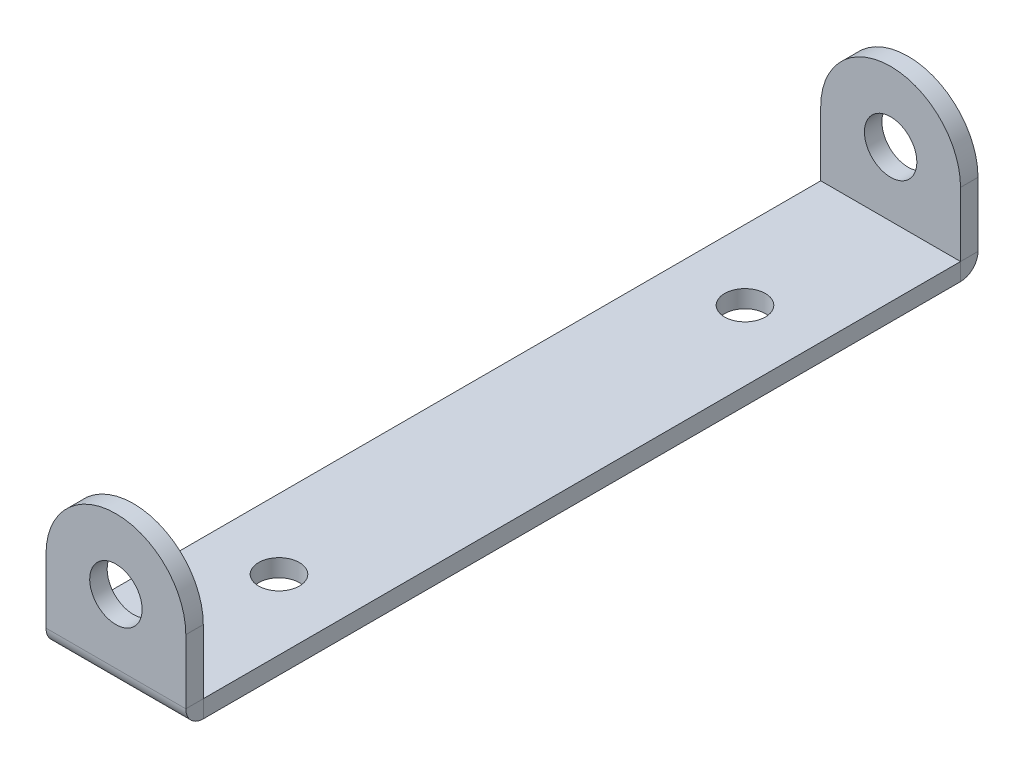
ISO-10303-21;
HEADER;
FILE_DESCRIPTION(('STEP AP214'),'2;1');
FILE_NAME('part.step','',(''),(''),'','','');
FILE_SCHEMA(('AUTOMOTIVE_DESIGN { 1 0 10303 214 1 1 1 1 }'));
ENDSEC;
DATA;
#1=APPLICATION_CONTEXT('core data for automotive mechanical design processes');
#2=APPLICATION_PROTOCOL_DEFINITION('international standard','automotive_design',2000,#1);
#3=PRODUCT_CONTEXT('',#1,'mechanical');
#4=PRODUCT('Part','Part','',(#3));
#5=PRODUCT_RELATED_PRODUCT_CATEGORY('part','',(#4));
#6=PRODUCT_DEFINITION_FORMATION('','',#4);
#7=PRODUCT_DEFINITION_CONTEXT('part definition',#1,'design');
#8=PRODUCT_DEFINITION('design','',#6,#7);
#9=PRODUCT_DEFINITION_SHAPE('','',#8);
#10=(LENGTH_UNIT() NAMED_UNIT(*) SI_UNIT(.MILLI.,.METRE.));
#11=(NAMED_UNIT(*) PLANE_ANGLE_UNIT() SI_UNIT($,.RADIAN.));
#12=(NAMED_UNIT(*) SI_UNIT($,.STERADIAN.) SOLID_ANGLE_UNIT());
#13=UNCERTAINTY_MEASURE_WITH_UNIT(LENGTH_MEASURE(1.E-05),#10,'distance_accuracy_value','');
#14=(GEOMETRIC_REPRESENTATION_CONTEXT(3) GLOBAL_UNCERTAINTY_ASSIGNED_CONTEXT((#13)) GLOBAL_UNIT_ASSIGNED_CONTEXT((#10,
#11,#12)) REPRESENTATION_CONTEXT('',''));
#15=CARTESIAN_POINT('',(0.,0.,0.));
#16=DIRECTION('',(0.,0.,1.));
#17=DIRECTION('',(1.,0.,0.));
#18=AXIS2_PLACEMENT_3D('',#15,#16,#17);
#19=CARTESIAN_POINT('',(0.,1.5,0.));
#20=DIRECTION('',(0.,1.,0.));
#21=DIRECTION('',(0.,0.,1.));
#22=AXIS2_PLACEMENT_3D('',#19,#20,#21);
#23=PLANE('',#22);
#24=CARTESIAN_POINT('',(0.,1.5,-21.));
#25=DIRECTION('',(0.,1.,0.));
#26=DIRECTION('',(0.,0.,1.));
#27=AXIS2_PLACEMENT_3D('',#24,#25,#26);
#28=CIRCLE('',#27,1.75);
#29=CARTESIAN_POINT('',(0.,1.5,-19.25));
#30=VERTEX_POINT('',#29);
#31=EDGE_CURVE('E204',#30,#30,#28,.T.);
#32=ORIENTED_EDGE('',*,*,#31,.F.);
#33=EDGE_LOOP('',(#32));
#34=FACE_BOUND('',#33,.T.);
#35=CARTESIAN_POINT('',(0.,1.5,-61.));
#36=DIRECTION('',(0.,1.,0.));
#37=DIRECTION('',(0.,0.,1.));
#38=AXIS2_PLACEMENT_3D('',#35,#36,#37);
#39=CIRCLE('',#38,1.75);
#40=CARTESIAN_POINT('',(0.,1.5,-59.25));
#41=VERTEX_POINT('',#40);
#42=EDGE_CURVE('E210',#41,#41,#39,.T.);
#43=ORIENTED_EDGE('',*,*,#42,.F.);
#44=EDGE_LOOP('',(#43));
#45=FACE_BOUND('',#44,.T.);
#46=DIRECTION('',(0.,0.,-1.));
#47=VECTOR('',#46,1.);
#48=CARTESIAN_POINT('',(6.,1.5,0.));
#49=LINE('',#48,#47);
#50=CARTESIAN_POINT('',(6.,1.5,-8.49999999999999));
#51=VERTEX_POINT('',#50);
#52=CARTESIAN_POINT('',(6.,1.5,-73.5));
#53=VERTEX_POINT('',#52);
#54=EDGE_CURVE('E44',#51,#53,#49,.T.);
#55=ORIENTED_EDGE('',*,*,#54,.T.);
#56=DIRECTION('',(-1.,0.,0.));
#57=VECTOR('',#56,1.);
#58=CARTESIAN_POINT('',(0.,1.5,-73.5));
#59=LINE('',#58,#57);
#60=CARTESIAN_POINT('',(-6.,1.5,-73.5));
#61=VERTEX_POINT('',#60);
#62=EDGE_CURVE('E224',#53,#61,#59,.T.);
#63=ORIENTED_EDGE('',*,*,#62,.T.);
#64=DIRECTION('',(0.,0.,1.));
#65=VECTOR('',#64,1.);
#66=CARTESIAN_POINT('',(-6.,1.5,0.));
#67=LINE('',#66,#65);
#68=CARTESIAN_POINT('',(-6.,1.5,-8.49999999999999));
#69=VERTEX_POINT('',#68);
#70=EDGE_CURVE('E217',#61,#69,#67,.T.);
#71=ORIENTED_EDGE('',*,*,#70,.T.);
#72=DIRECTION('',(-1.,0.,0.));
#73=VECTOR('',#72,1.);
#74=CARTESIAN_POINT('',(0.,1.5,-8.49999999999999));
#75=LINE('',#74,#73);
#76=EDGE_CURVE('E213',#51,#69,#75,.T.);
#77=ORIENTED_EDGE('',*,*,#76,.F.);
#78=EDGE_LOOP('',(#55,#63,#71,#77));
#79=FACE_BOUND('',#78,.T.);
#80=ADVANCED_FACE('F40',(#34,#45,#79),#23,.T.);
#81=CARTESIAN_POINT('',(-6.,1.5,0.));
#82=DIRECTION('',(1.,0.,0.));
#83=DIRECTION('',(0.,0.,-1.));
#84=AXIS2_PLACEMENT_3D('',#81,#82,#83);
#85=PLANE('',#84);
#86=DIRECTION('',(0.,1.,0.));
#87=VECTOR('',#86,1.);
#88=CARTESIAN_POINT('',(-6.,1.5,-73.5));
#89=LINE('',#88,#87);
#90=CARTESIAN_POINT('',(-6.,0.,-73.5));
#91=VERTEX_POINT('',#90);
#92=EDGE_CURVE('E12',#91,#61,#89,.T.);
#93=ORIENTED_EDGE('',*,*,#92,.F.);
#94=DIRECTION('',(0.,0.,1.));
#95=VECTOR('',#94,1.);
#96=CARTESIAN_POINT('',(-6.,0.,0.));
#97=LINE('',#96,#95);
#98=CARTESIAN_POINT('',(-6.,0.,-8.49999999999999));
#99=VERTEX_POINT('',#98);
#100=EDGE_CURVE('E57',#91,#99,#97,.T.);
#101=ORIENTED_EDGE('',*,*,#100,.T.);
#102=DIRECTION('',(0.,1.,0.));
#103=VECTOR('',#102,1.);
#104=CARTESIAN_POINT('',(-6.,1.5,-8.49999999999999));
#105=LINE('',#104,#103);
#106=EDGE_CURVE('E216',#99,#69,#105,.T.);
#107=ORIENTED_EDGE('',*,*,#106,.T.);
#108=ORIENTED_EDGE('',*,*,#70,.F.);
#109=EDGE_LOOP('',(#93,#101,#107,#108));
#110=FACE_BOUND('',#109,.T.);
#111=ADVANCED_FACE('F42',(#110),#85,.F.);
#112=CARTESIAN_POINT('',(6.,1.5,0.));
#113=DIRECTION('',(-1.,0.,0.));
#114=DIRECTION('',(0.,0.,1.));
#115=AXIS2_PLACEMENT_3D('',#112,#113,#114);
#116=PLANE('',#115);
#117=DIRECTION('',(0.,-1.,0.));
#118=VECTOR('',#117,1.);
#119=CARTESIAN_POINT('',(6.,1.5,-73.5));
#120=LINE('',#119,#118);
#121=CARTESIAN_POINT('',(6.,0.,-73.5));
#122=VERTEX_POINT('',#121);
#123=EDGE_CURVE('E227',#53,#122,#120,.T.);
#124=ORIENTED_EDGE('',*,*,#123,.F.);
#125=ORIENTED_EDGE('',*,*,#54,.F.);
#126=DIRECTION('',(0.,-1.,0.));
#127=VECTOR('',#126,1.);
#128=CARTESIAN_POINT('',(6.,1.5,-8.49999999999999));
#129=LINE('',#128,#127);
#130=CARTESIAN_POINT('',(6.,0.,-8.49999999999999));
#131=VERTEX_POINT('',#130);
#132=EDGE_CURVE('E222',#51,#131,#129,.T.);
#133=ORIENTED_EDGE('',*,*,#132,.T.);
#134=DIRECTION('',(0.,0.,-1.));
#135=VECTOR('',#134,1.);
#136=CARTESIAN_POINT('',(6.,0.,0.));
#137=LINE('',#136,#135);
#138=EDGE_CURVE('E65',#131,#122,#137,.T.);
#139=ORIENTED_EDGE('',*,*,#138,.T.);
#140=EDGE_LOOP('',(#124,#125,#133,#139));
#141=FACE_BOUND('',#140,.T.);
#142=ADVANCED_FACE('F238',(#141),#116,.F.);
#143=CARTESIAN_POINT('',(0.,0.,0.));
#144=DIRECTION('',(0.,1.,0.));
#145=DIRECTION('',(0.,0.,1.));
#146=AXIS2_PLACEMENT_3D('',#143,#144,#145);
#147=PLANE('',#146);
#148=DIRECTION('',(-1.,0.,0.));
#149=VECTOR('',#148,1.);
#150=CARTESIAN_POINT('',(0.,0.,-73.5));
#151=LINE('',#150,#149);
#152=EDGE_CURVE('E49',#122,#91,#151,.T.);
#153=ORIENTED_EDGE('',*,*,#152,.F.);
#154=ORIENTED_EDGE('',*,*,#138,.F.);
#155=DIRECTION('',(-1.,0.,0.));
#156=VECTOR('',#155,1.);
#157=CARTESIAN_POINT('',(0.,0.,-8.49999999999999));
#158=LINE('',#157,#156);
#159=EDGE_CURVE('E220',#131,#99,#158,.T.);
#160=ORIENTED_EDGE('',*,*,#159,.T.);
#161=ORIENTED_EDGE('',*,*,#100,.F.);
#162=EDGE_LOOP('',(#153,#154,#160,#161));
#163=FACE_BOUND('',#162,.T.);
#164=CARTESIAN_POINT('',(0.,0.,-21.));
#165=DIRECTION('',(0.,1.,0.));
#166=DIRECTION('',(0.,0.,1.));
#167=AXIS2_PLACEMENT_3D('',#164,#165,#166);
#168=CIRCLE('',#167,1.75);
#169=CARTESIAN_POINT('',(0.,0.,-19.25));
#170=VERTEX_POINT('',#169);
#171=EDGE_CURVE('E201',#170,#170,#168,.T.);
#172=ORIENTED_EDGE('',*,*,#171,.T.);
#173=EDGE_LOOP('',(#172));
#174=FACE_BOUND('',#173,.T.);
#175=CARTESIAN_POINT('',(0.,0.,-61.));
#176=DIRECTION('',(0.,1.,0.));
#177=DIRECTION('',(0.,0.,1.));
#178=AXIS2_PLACEMENT_3D('',#175,#176,#177);
#179=CIRCLE('',#178,1.75);
#180=CARTESIAN_POINT('',(0.,0.,-59.25));
#181=VERTEX_POINT('',#180);
#182=EDGE_CURVE('E207',#181,#181,#179,.T.);
#183=ORIENTED_EDGE('',*,*,#182,.T.);
#184=EDGE_LOOP('',(#183));
#185=FACE_BOUND('',#184,.T.);
#186=ADVANCED_FACE('F287',(#163,#174,#185),#147,.F.);
#187=CARTESIAN_POINT('',(0.,1.5,-61.));
#188=DIRECTION('',(0.,-1.,0.));
#189=DIRECTION('',(0.,0.,-1.));
#190=AXIS2_PLACEMENT_3D('',#187,#188,#189);
#191=CYLINDRICAL_SURFACE('',#190,1.75);
#192=ORIENTED_EDGE('',*,*,#42,.T.);
#193=EDGE_LOOP('',(#192));
#194=FACE_BOUND('',#193,.T.);
#195=ORIENTED_EDGE('',*,*,#182,.F.);
#196=EDGE_LOOP('',(#195));
#197=FACE_BOUND('',#196,.T.);
#198=ADVANCED_FACE('F310',(#194,#197),#191,.F.);
#199=CARTESIAN_POINT('',(0.,1.5,-21.));
#200=DIRECTION('',(0.,-1.,0.));
#201=DIRECTION('',(0.,0.,-1.));
#202=AXIS2_PLACEMENT_3D('',#199,#200,#201);
#203=CYLINDRICAL_SURFACE('',#202,1.75);
#204=ORIENTED_EDGE('',*,*,#31,.T.);
#205=EDGE_LOOP('',(#204));
#206=FACE_BOUND('',#205,.T.);
#207=ORIENTED_EDGE('',*,*,#171,.F.);
#208=EDGE_LOOP('',(#207));
#209=FACE_BOUND('',#208,.T.);
#210=ADVANCED_FACE('F317',(#206,#209),#203,.F.);
#211=CARTESIAN_POINT('',(-6.,1.5,-8.49999999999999));
#212=DIRECTION('',(-1.,0.,0.));
#213=DIRECTION('',(0.,0.,1.));
#214=AXIS2_PLACEMENT_3D('',#211,#212,#213);
#215=PLANE('',#214);
#216=CARTESIAN_POINT('',(-6.,1.5,-8.49999999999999));
#217=DIRECTION('',(1.,0.,0.));
#218=DIRECTION('',(0.,0.,-1.));
#219=AXIS2_PLACEMENT_3D('',#216,#217,#218);
#220=CIRCLE('',#219,1.5);
#221=CARTESIAN_POINT('',(-6.,1.5,-6.99999999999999));
#222=VERTEX_POINT('',#221);
#223=EDGE_CURVE('E199',#222,#99,#220,.T.);
#224=ORIENTED_EDGE('',*,*,#223,.F.);
#225=DIRECTION('',(0.,0.,-1.));
#226=VECTOR('',#225,1.);
#227=CARTESIAN_POINT('',(-6.,1.5,-8.49999999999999));
#228=LINE('',#227,#226);
#229=EDGE_CURVE('E189',#222,#69,#228,.T.);
#230=ORIENTED_EDGE('',*,*,#229,.T.);
#231=ORIENTED_EDGE('',*,*,#106,.F.);
#232=EDGE_LOOP('',(#224,#230,#231));
#233=FACE_BOUND('',#232,.T.);
#234=ADVANCED_FACE('F269',(#233),#215,.T.);
#235=CARTESIAN_POINT('',(6.,1.5,-8.49999999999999));
#236=DIRECTION('',(1.,0.,0.));
#237=DIRECTION('',(0.,0.,-1.));
#238=AXIS2_PLACEMENT_3D('',#235,#236,#237);
#239=CYLINDRICAL_SURFACE('',#238,1.5);
#240=CARTESIAN_POINT('',(6.,1.5,-8.49999999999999));
#241=DIRECTION('',(1.,0.,0.));
#242=DIRECTION('',(0.,0.,-1.));
#243=AXIS2_PLACEMENT_3D('',#240,#241,#242);
#244=CIRCLE('',#243,1.5);
#245=CARTESIAN_POINT('',(6.,1.5,-6.99999999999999));
#246=VERTEX_POINT('',#245);
#247=EDGE_CURVE('E164',#246,#131,#244,.T.);
#248=ORIENTED_EDGE('',*,*,#247,.F.);
#249=DIRECTION('',(-1.,0.,0.));
#250=VECTOR('',#249,1.);
#251=CARTESIAN_POINT('',(0.,1.5,-6.99999999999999));
#252=LINE('',#251,#250);
#253=EDGE_CURVE('E192',#246,#222,#252,.T.);
#254=ORIENTED_EDGE('',*,*,#253,.T.);
#255=ORIENTED_EDGE('',*,*,#223,.T.);
#256=ORIENTED_EDGE('',*,*,#159,.F.);
#257=EDGE_LOOP('',(#248,#254,#255,#256));
#258=FACE_BOUND('',#257,.T.);
#259=ADVANCED_FACE('F330',(#258),#239,.T.);
#260=CARTESIAN_POINT('',(6.,1.5,-8.49999999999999));
#261=DIRECTION('',(1.,0.,0.));
#262=DIRECTION('',(0.,0.,-1.));
#263=AXIS2_PLACEMENT_3D('',#260,#261,#262);
#264=PLANE('',#263);
#265=DIRECTION('',(0.,0.,1.));
#266=VECTOR('',#265,1.);
#267=CARTESIAN_POINT('',(6.,1.5,-8.49999999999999));
#268=LINE('',#267,#266);
#269=EDGE_CURVE('E161',#51,#246,#268,.T.);
#270=ORIENTED_EDGE('',*,*,#269,.T.);
#271=ORIENTED_EDGE('',*,*,#247,.T.);
#272=ORIENTED_EDGE('',*,*,#132,.F.);
#273=EDGE_LOOP('',(#270,#271,#272));
#274=FACE_BOUND('',#273,.T.);
#275=ADVANCED_FACE('F284',(#274),#264,.T.);
#276=CARTESIAN_POINT('',(0.,7.00999999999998,-8.50000000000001));
#277=DIRECTION('',(0.,0.,1.));
#278=DIRECTION('',(0.,-1.,0.));
#279=AXIS2_PLACEMENT_3D('',#276,#277,#278);
#280=CYLINDRICAL_SURFACE('',#279,6.);
#281=CARTESIAN_POINT('',(0.,7.00999999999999,-7.00000000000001));
#282=DIRECTION('',(0.,0.,-1.));
#283=DIRECTION('',(0.,1.,0.));
#284=AXIS2_PLACEMENT_3D('',#281,#282,#283);
#285=CIRCLE('',#284,6.);
#286=CARTESIAN_POINT('',(-6.,7.00999999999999,-7.00000000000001));
#287=VERTEX_POINT('',#286);
#288=CARTESIAN_POINT('',(6.,7.00999999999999,-7.00000000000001));
#289=VERTEX_POINT('',#288);
#290=EDGE_CURVE('E186',#287,#289,#285,.T.);
#291=ORIENTED_EDGE('',*,*,#290,.T.);
#292=DIRECTION('',(0.,0.,1.));
#293=VECTOR('',#292,1.);
#294=CARTESIAN_POINT('',(6.,7.00999999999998,-8.50000000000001));
#295=LINE('',#294,#293);
#296=CARTESIAN_POINT('',(6.,7.00999999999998,-8.50000000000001));
#297=VERTEX_POINT('',#296);
#298=EDGE_CURVE('E165',#297,#289,#295,.T.);
#299=ORIENTED_EDGE('',*,*,#298,.F.);
#300=CARTESIAN_POINT('',(0.,7.00999999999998,-8.50000000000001));
#301=DIRECTION('',(0.,0.,-1.));
#302=DIRECTION('',(0.,1.,0.));
#303=AXIS2_PLACEMENT_3D('',#300,#301,#302);
#304=CIRCLE('',#303,6.);
#305=CARTESIAN_POINT('',(-6.,7.00999999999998,-8.50000000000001));
#306=VERTEX_POINT('',#305);
#307=EDGE_CURVE('E173',#306,#297,#304,.T.);
#308=ORIENTED_EDGE('',*,*,#307,.F.);
#309=DIRECTION('',(0.,0.,1.));
#310=VECTOR('',#309,1.);
#311=CARTESIAN_POINT('',(-6.,7.00999999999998,-8.50000000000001));
#312=LINE('',#311,#310);
#313=EDGE_CURVE('E183',#306,#287,#312,.T.);
#314=ORIENTED_EDGE('',*,*,#313,.T.);
#315=EDGE_LOOP('',(#291,#299,#308,#314));
#316=FACE_BOUND('',#315,.T.);
#317=ADVANCED_FACE('F338',(#316),#280,.T.);
#318=CARTESIAN_POINT('',(0.,7.00999999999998,-8.50000000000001));
#319=DIRECTION('',(0.,0.,1.));
#320=DIRECTION('',(0.,-1.,0.));
#321=AXIS2_PLACEMENT_3D('',#318,#319,#320);
#322=CYLINDRICAL_SURFACE('',#321,2.25);
#323=CARTESIAN_POINT('',(0.,7.00999999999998,-8.50000000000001));
#324=DIRECTION('',(0.,0.,-1.));
#325=DIRECTION('',(0.,1.,0.));
#326=AXIS2_PLACEMENT_3D('',#323,#324,#325);
#327=CIRCLE('',#326,2.25);
#328=CARTESIAN_POINT('',(0.,9.25999999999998,-8.50000000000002));
#329=VERTEX_POINT('',#328);
#330=EDGE_CURVE('E180',#329,#329,#327,.T.);
#331=ORIENTED_EDGE('',*,*,#330,.T.);
#332=EDGE_LOOP('',(#331));
#333=FACE_BOUND('',#332,.T.);
#334=CARTESIAN_POINT('',(0.,7.00999999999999,-7.00000000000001));
#335=DIRECTION('',(0.,0.,-1.));
#336=DIRECTION('',(0.,1.,0.));
#337=AXIS2_PLACEMENT_3D('',#334,#335,#336);
#338=CIRCLE('',#337,2.25);
#339=CARTESIAN_POINT('',(0.,9.25999999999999,-7.00000000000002));
#340=VERTEX_POINT('',#339);
#341=EDGE_CURVE('E168',#340,#340,#338,.T.);
#342=ORIENTED_EDGE('',*,*,#341,.F.);
#343=EDGE_LOOP('',(#342));
#344=FACE_BOUND('',#343,.T.);
#345=ADVANCED_FACE('F349',(#333,#344),#322,.F.);
#346=CARTESIAN_POINT('',(0.,7.00999999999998,-8.50000000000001));
#347=DIRECTION('',(0.,0.,-1.));
#348=DIRECTION('',(0.,1.,0.));
#349=AXIS2_PLACEMENT_3D('',#346,#347,#348);
#350=PLANE('',#349);
#351=ORIENTED_EDGE('',*,*,#330,.F.);
#352=EDGE_LOOP('',(#351));
#353=FACE_BOUND('',#352,.T.);
#354=DIRECTION('',(0.,-1.,0.));
#355=VECTOR('',#354,1.);
#356=CARTESIAN_POINT('',(6.,7.00999999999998,-8.50000000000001));
#357=LINE('',#356,#355);
#358=EDGE_CURVE('E178',#297,#51,#357,.T.);
#359=ORIENTED_EDGE('',*,*,#358,.T.);
#360=ORIENTED_EDGE('',*,*,#76,.T.);
#361=DIRECTION('',(0.,1.,0.));
#362=VECTOR('',#361,1.);
#363=CARTESIAN_POINT('',(-6.,7.00999999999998,-8.50000000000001));
#364=LINE('',#363,#362);
#365=EDGE_CURVE('E176',#69,#306,#364,.T.);
#366=ORIENTED_EDGE('',*,*,#365,.T.);
#367=ORIENTED_EDGE('',*,*,#307,.T.);
#368=EDGE_LOOP('',(#359,#360,#366,#367));
#369=FACE_BOUND('',#368,.T.);
#370=ADVANCED_FACE('F276',(#353,#369),#350,.T.);
#371=CARTESIAN_POINT('',(-6.,7.00999999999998,-8.50000000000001));
#372=DIRECTION('',(1.,0.,0.));
#373=DIRECTION('',(0.,-1.,0.));
#374=AXIS2_PLACEMENT_3D('',#371,#372,#373);
#375=PLANE('',#374);
#376=ORIENTED_EDGE('',*,*,#229,.F.);
#377=DIRECTION('',(0.,1.,0.));
#378=VECTOR('',#377,1.);
#379=CARTESIAN_POINT('',(-6.,7.00999999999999,-7.00000000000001));
#380=LINE('',#379,#378);
#381=EDGE_CURVE('E171',#222,#287,#380,.T.);
#382=ORIENTED_EDGE('',*,*,#381,.T.);
#383=ORIENTED_EDGE('',*,*,#313,.F.);
#384=ORIENTED_EDGE('',*,*,#365,.F.);
#385=EDGE_LOOP('',(#376,#382,#383,#384));
#386=FACE_BOUND('',#385,.T.);
#387=ADVANCED_FACE('F272',(#386),#375,.F.);
#388=CARTESIAN_POINT('',(0.,7.00999999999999,-7.00000000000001));
#389=DIRECTION('',(0.,0.,-1.));
#390=DIRECTION('',(0.,1.,0.));
#391=AXIS2_PLACEMENT_3D('',#388,#389,#390);
#392=PLANE('',#391);
#393=ORIENTED_EDGE('',*,*,#253,.F.);
#394=DIRECTION('',(0.,-1.,0.));
#395=VECTOR('',#394,1.);
#396=CARTESIAN_POINT('',(6.,7.00999999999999,-7.00000000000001));
#397=LINE('',#396,#395);
#398=EDGE_CURVE('E162',#289,#246,#397,.T.);
#399=ORIENTED_EDGE('',*,*,#398,.F.);
#400=ORIENTED_EDGE('',*,*,#290,.F.);
#401=ORIENTED_EDGE('',*,*,#381,.F.);
#402=EDGE_LOOP('',(#393,#399,#400,#401));
#403=FACE_BOUND('',#402,.T.);
#404=ORIENTED_EDGE('',*,*,#341,.T.);
#405=EDGE_LOOP('',(#404));
#406=FACE_BOUND('',#405,.T.);
#407=ADVANCED_FACE('F341',(#403,#406),#392,.F.);
#408=CARTESIAN_POINT('',(6.,7.00999999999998,-8.50000000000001));
#409=DIRECTION('',(-1.,0.,0.));
#410=DIRECTION('',(0.,1.,0.));
#411=AXIS2_PLACEMENT_3D('',#408,#409,#410);
#412=PLANE('',#411);
#413=ORIENTED_EDGE('',*,*,#269,.F.);
#414=ORIENTED_EDGE('',*,*,#358,.F.);
#415=ORIENTED_EDGE('',*,*,#298,.T.);
#416=ORIENTED_EDGE('',*,*,#398,.T.);
#417=EDGE_LOOP('',(#413,#414,#415,#416));
#418=FACE_BOUND('',#417,.T.);
#419=ADVANCED_FACE('F281',(#418),#412,.F.);
#420=CARTESIAN_POINT('',(6.,1.5,-73.5));
#421=DIRECTION('',(-1.,0.,0.));
#422=DIRECTION('',(0.,0.,1.));
#423=AXIS2_PLACEMENT_3D('',#420,#421,#422);
#424=PLANE('',#423);
#425=CARTESIAN_POINT('',(6.,1.5,-73.5));
#426=DIRECTION('',(-1.,0.,0.));
#427=DIRECTION('',(0.,0.,1.));
#428=AXIS2_PLACEMENT_3D('',#425,#426,#427);
#429=CIRCLE('',#428,1.5);
#430=CARTESIAN_POINT('',(6.,1.5,-75.));
#431=VERTEX_POINT('',#430);
#432=EDGE_CURVE('E157',#431,#122,#429,.T.);
#433=ORIENTED_EDGE('',*,*,#432,.F.);
#434=DIRECTION('',(0.,0.,-1.));
#435=VECTOR('',#434,1.);
#436=CARTESIAN_POINT('',(6.,1.5,-73.5));
#437=LINE('',#436,#435);
#438=EDGE_CURVE('E130',#53,#431,#437,.T.);
#439=ORIENTED_EDGE('',*,*,#438,.F.);
#440=ORIENTED_EDGE('',*,*,#123,.T.);
#441=EDGE_LOOP('',(#433,#439,#440));
#442=FACE_BOUND('',#441,.T.);
#443=ADVANCED_FACE('F241',(#442),#424,.F.);
#444=CARTESIAN_POINT('',(-6.,1.5,-73.5));
#445=DIRECTION('',(-1.,0.,0.));
#446=DIRECTION('',(0.,0.,1.));
#447=AXIS2_PLACEMENT_3D('',#444,#445,#446);
#448=CYLINDRICAL_SURFACE('',#447,1.5);
#449=CARTESIAN_POINT('',(-6.,1.5,-73.5));
#450=DIRECTION('',(-1.,0.,0.));
#451=DIRECTION('',(0.,0.,1.));
#452=AXIS2_PLACEMENT_3D('',#449,#450,#451);
#453=CIRCLE('',#452,1.5);
#454=CARTESIAN_POINT('',(-6.,1.50000000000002,-75.));
#455=VERTEX_POINT('',#454);
#456=EDGE_CURVE('E154',#455,#91,#453,.T.);
#457=ORIENTED_EDGE('',*,*,#456,.F.);
#458=DIRECTION('',(-1.,0.,0.));
#459=VECTOR('',#458,1.);
#460=CARTESIAN_POINT('',(0.,1.5,-75.));
#461=LINE('',#460,#459);
#462=EDGE_CURVE('E255',#431,#455,#461,.T.);
#463=ORIENTED_EDGE('',*,*,#462,.F.);
#464=ORIENTED_EDGE('',*,*,#432,.T.);
#465=ORIENTED_EDGE('',*,*,#152,.T.);
#466=EDGE_LOOP('',(#457,#463,#464,#465));
#467=FACE_BOUND('',#466,.T.);
#468=ADVANCED_FACE('F290',(#467),#448,.T.);
#469=CARTESIAN_POINT('',(-6.,1.5,-73.5));
#470=DIRECTION('',(1.,0.,0.));
#471=DIRECTION('',(0.,0.,-1.));
#472=AXIS2_PLACEMENT_3D('',#469,#470,#471);
#473=PLANE('',#472);
#474=DIRECTION('',(0.,0.,1.));
#475=VECTOR('',#474,1.);
#476=CARTESIAN_POINT('',(-6.,1.5,-73.5));
#477=LINE('',#476,#475);
#478=EDGE_CURVE('E258',#455,#61,#477,.T.);
#479=ORIENTED_EDGE('',*,*,#478,.F.);
#480=ORIENTED_EDGE('',*,*,#456,.T.);
#481=ORIENTED_EDGE('',*,*,#92,.T.);
#482=EDGE_LOOP('',(#479,#480,#481));
#483=FACE_BOUND('',#482,.T.);
#484=ADVANCED_FACE('F264',(#483),#473,.F.);
#485=CARTESIAN_POINT('',(0.,7.00999999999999,-73.5));
#486=DIRECTION('',(0.,0.,-1.));
#487=DIRECTION('',(0.,1.,0.));
#488=AXIS2_PLACEMENT_3D('',#485,#486,#487);
#489=CYLINDRICAL_SURFACE('',#488,2.25);
#490=CARTESIAN_POINT('',(0.,7.00999999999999,-73.5));
#491=DIRECTION('',(0.,0.,1.));
#492=DIRECTION('',(0.,-1.,0.));
#493=AXIS2_PLACEMENT_3D('',#490,#491,#492);
#494=CIRCLE('',#493,2.25);
#495=CARTESIAN_POINT('',(0.,4.75999999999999,-73.5));
#496=VERTEX_POINT('',#495);
#497=EDGE_CURVE('E148',#496,#496,#494,.T.);
#498=ORIENTED_EDGE('',*,*,#497,.T.);
#499=EDGE_LOOP('',(#498));
#500=FACE_BOUND('',#499,.T.);
#501=CARTESIAN_POINT('',(0.,7.00999999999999,-75.));
#502=DIRECTION('',(0.,0.,1.));
#503=DIRECTION('',(0.,-1.,0.));
#504=AXIS2_PLACEMENT_3D('',#501,#502,#503);
#505=CIRCLE('',#504,2.25);
#506=CARTESIAN_POINT('',(0.,4.75999999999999,-75.));
#507=VERTEX_POINT('',#506);
#508=EDGE_CURVE('E134',#507,#507,#505,.T.);
#509=ORIENTED_EDGE('',*,*,#508,.F.);
#510=EDGE_LOOP('',(#509));
#511=FACE_BOUND('',#510,.T.);
#512=ADVANCED_FACE('F297',(#500,#511),#489,.F.);
#513=CARTESIAN_POINT('',(0.,7.00999999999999,-73.5));
#514=DIRECTION('',(0.,0.,-1.));
#515=DIRECTION('',(0.,1.,0.));
#516=AXIS2_PLACEMENT_3D('',#513,#514,#515);
#517=CYLINDRICAL_SURFACE('',#516,6.);
#518=CARTESIAN_POINT('',(0.,7.00999999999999,-75.));
#519=DIRECTION('',(0.,0.,1.));
#520=DIRECTION('',(0.,-1.,0.));
#521=AXIS2_PLACEMENT_3D('',#518,#519,#520);
#522=CIRCLE('',#521,6.);
#523=CARTESIAN_POINT('',(6.,7.00999999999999,-75.));
#524=VERTEX_POINT('',#523);
#525=CARTESIAN_POINT('',(-6.,7.00999999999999,-75.));
#526=VERTEX_POINT('',#525);
#527=EDGE_CURVE('E139',#524,#526,#522,.T.);
#528=ORIENTED_EDGE('',*,*,#527,.T.);
#529=DIRECTION('',(0.,0.,-1.));
#530=VECTOR('',#529,1.);
#531=CARTESIAN_POINT('',(-6.,7.00999999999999,-73.5));
#532=LINE('',#531,#530);
#533=CARTESIAN_POINT('',(-6.,7.00999999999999,-73.5));
#534=VERTEX_POINT('',#533);
#535=EDGE_CURVE('E158',#534,#526,#532,.T.);
#536=ORIENTED_EDGE('',*,*,#535,.F.);
#537=CARTESIAN_POINT('',(0.,7.00999999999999,-73.5));
#538=DIRECTION('',(0.,0.,1.));
#539=DIRECTION('',(0.,-1.,0.));
#540=AXIS2_PLACEMENT_3D('',#537,#538,#539);
#541=CIRCLE('',#540,6.);
#542=CARTESIAN_POINT('',(6.,7.00999999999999,-73.5));
#543=VERTEX_POINT('',#542);
#544=EDGE_CURVE('E141',#543,#534,#541,.T.);
#545=ORIENTED_EDGE('',*,*,#544,.F.);
#546=DIRECTION('',(0.,0.,-1.));
#547=VECTOR('',#546,1.);
#548=CARTESIAN_POINT('',(6.,7.00999999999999,-73.5));
#549=LINE('',#548,#547);
#550=EDGE_CURVE('E127',#543,#524,#549,.T.);
#551=ORIENTED_EDGE('',*,*,#550,.T.);
#552=EDGE_LOOP('',(#528,#536,#545,#551));
#553=FACE_BOUND('',#552,.T.);
#554=ADVANCED_FACE('F137',(#553),#517,.T.);
#555=CARTESIAN_POINT('',(0.,-74.99,-73.5000000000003));
#556=DIRECTION('',(0.,0.,1.));
#557=DIRECTION('',(0.,-1.,0.));
#558=AXIS2_PLACEMENT_3D('',#555,#556,#557);
#559=PLANE('',#558);
#560=ORIENTED_EDGE('',*,*,#62,.F.);
#561=DIRECTION('',(0.,1.,0.));
#562=VECTOR('',#561,1.);
#563=CARTESIAN_POINT('',(6.,-74.99,-73.5000000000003));
#564=LINE('',#563,#562);
#565=EDGE_CURVE('E142',#53,#543,#564,.T.);
#566=ORIENTED_EDGE('',*,*,#565,.T.);
#567=ORIENTED_EDGE('',*,*,#544,.T.);
#568=DIRECTION('',(0.,-1.,0.));
#569=VECTOR('',#568,1.);
#570=CARTESIAN_POINT('',(-6.,-74.99,-73.5000000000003));
#571=LINE('',#570,#569);
#572=EDGE_CURVE('E242',#534,#61,#571,.T.);
#573=ORIENTED_EDGE('',*,*,#572,.T.);
#574=EDGE_LOOP('',(#560,#566,#567,#573));
#575=FACE_BOUND('',#574,.T.);
#576=ORIENTED_EDGE('',*,*,#497,.F.);
#577=EDGE_LOOP('',(#576));
#578=FACE_BOUND('',#577,.T.);
#579=ADVANCED_FACE('F246',(#575,#578),#559,.T.);
#580=CARTESIAN_POINT('',(6.,-74.99,-73.5000000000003));
#581=DIRECTION('',(-1.,0.,0.));
#582=DIRECTION('',(0.,-1.,0.));
#583=AXIS2_PLACEMENT_3D('',#580,#581,#582);
#584=PLANE('',#583);
#585=ORIENTED_EDGE('',*,*,#565,.F.);
#586=ORIENTED_EDGE('',*,*,#438,.T.);
#587=DIRECTION('',(0.,1.,0.));
#588=VECTOR('',#587,1.);
#589=CARTESIAN_POINT('',(6.,-74.99,-75.0000000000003));
#590=LINE('',#589,#588);
#591=EDGE_CURVE('E123',#431,#524,#590,.T.);
#592=ORIENTED_EDGE('',*,*,#591,.T.);
#593=ORIENTED_EDGE('',*,*,#550,.F.);
#594=EDGE_LOOP('',(#585,#586,#592,#593));
#595=FACE_BOUND('',#594,.T.);
#596=ADVANCED_FACE('F126',(#595),#584,.F.);
#597=CARTESIAN_POINT('',(0.,-74.99,-75.0000000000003));
#598=DIRECTION('',(0.,0.,1.));
#599=DIRECTION('',(0.,-1.,0.));
#600=AXIS2_PLACEMENT_3D('',#597,#598,#599);
#601=PLANE('',#600);
#602=ORIENTED_EDGE('',*,*,#508,.T.);
#603=EDGE_LOOP('',(#602));
#604=FACE_BOUND('',#603,.T.);
#605=ORIENTED_EDGE('',*,*,#591,.F.);
#606=ORIENTED_EDGE('',*,*,#462,.T.);
#607=DIRECTION('',(0.,-1.,0.));
#608=VECTOR('',#607,1.);
#609=CARTESIAN_POINT('',(-6.,-74.99,-75.0000000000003));
#610=LINE('',#609,#608);
#611=EDGE_CURVE('E147',#526,#455,#610,.T.);
#612=ORIENTED_EDGE('',*,*,#611,.F.);
#613=ORIENTED_EDGE('',*,*,#527,.F.);
#614=EDGE_LOOP('',(#605,#606,#612,#613));
#615=FACE_BOUND('',#614,.T.);
#616=ADVANCED_FACE('F145',(#604,#615),#601,.F.);
#617=CARTESIAN_POINT('',(-6.,-74.99,-73.5000000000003));
#618=DIRECTION('',(1.,0.,0.));
#619=DIRECTION('',(0.,1.,0.));
#620=AXIS2_PLACEMENT_3D('',#617,#618,#619);
#621=PLANE('',#620);
#622=ORIENTED_EDGE('',*,*,#611,.T.);
#623=ORIENTED_EDGE('',*,*,#478,.T.);
#624=ORIENTED_EDGE('',*,*,#572,.F.);
#625=ORIENTED_EDGE('',*,*,#535,.T.);
#626=EDGE_LOOP('',(#622,#623,#624,#625));
#627=FACE_BOUND('',#626,.T.);
#628=ADVANCED_FACE('F261',(#627),#621,.F.);
#629=CLOSED_SHELL('',(#80,#111,#142,#186,#198,#210,#234,#259,#275,#317,#345,#370,#387,#407,#419,
#443,#468,#484,#512,#554,#579,#596,#616,#628));
#630=MANIFOLD_SOLID_BREP('B2',#629);
#631=ADVANCED_BREP_SHAPE_REPRESENTATION('',(#18,#630),#14);
#632=SHAPE_DEFINITION_REPRESENTATION(#9,#631);
ENDSEC;
END-ISO-10303-21;
